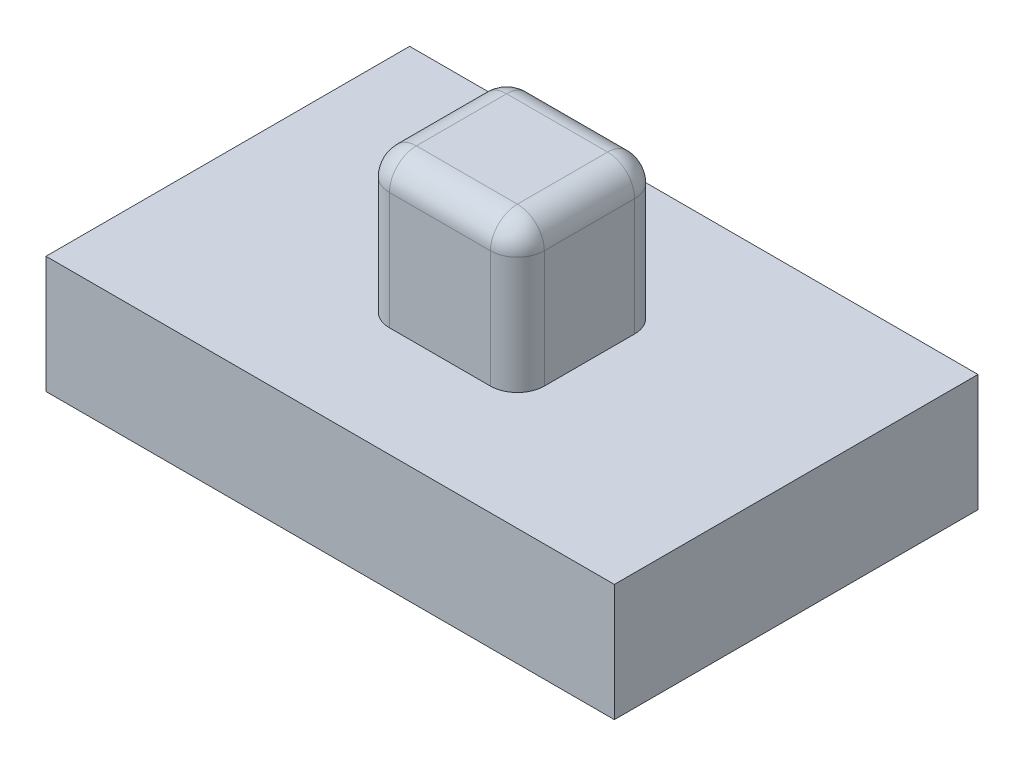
ISO-10303-21;
HEADER;
FILE_DESCRIPTION(('STEP AP214'),'2;1');
FILE_NAME('part.step','',(''),(''),'','','');
FILE_SCHEMA(('AUTOMOTIVE_DESIGN { 1 0 10303 214 1 1 1 1 }'));
ENDSEC;
DATA;
#1=APPLICATION_CONTEXT('core data for automotive mechanical design processes');
#2=APPLICATION_PROTOCOL_DEFINITION('international standard','automotive_design',2000,#1);
#3=PRODUCT_CONTEXT('',#1,'mechanical');
#4=PRODUCT('Part','Part','',(#3));
#5=PRODUCT_RELATED_PRODUCT_CATEGORY('part','',(#4));
#6=PRODUCT_DEFINITION_FORMATION('','',#4);
#7=PRODUCT_DEFINITION_CONTEXT('part definition',#1,'design');
#8=PRODUCT_DEFINITION('design','',#6,#7);
#9=PRODUCT_DEFINITION_SHAPE('','',#8);
#10=(LENGTH_UNIT() NAMED_UNIT(*) SI_UNIT(.MILLI.,.METRE.));
#11=(NAMED_UNIT(*) PLANE_ANGLE_UNIT() SI_UNIT($,.RADIAN.));
#12=(NAMED_UNIT(*) SI_UNIT($,.STERADIAN.) SOLID_ANGLE_UNIT());
#13=UNCERTAINTY_MEASURE_WITH_UNIT(LENGTH_MEASURE(1.E-05),#10,'distance_accuracy_value','');
#14=(GEOMETRIC_REPRESENTATION_CONTEXT(3) GLOBAL_UNCERTAINTY_ASSIGNED_CONTEXT((#13)) GLOBAL_UNIT_ASSIGNED_CONTEXT((#10,
#11,#12)) REPRESENTATION_CONTEXT('',''));
#15=CARTESIAN_POINT('',(0.,0.,0.));
#16=DIRECTION('',(0.,0.,1.));
#17=DIRECTION('',(1.,0.,0.));
#18=AXIS2_PLACEMENT_3D('',#15,#16,#17);
#19=CARTESIAN_POINT('',(0.,0.87,0.));
#20=DIRECTION('',(0.,-1.,0.));
#21=DIRECTION('',(0.,0.,-1.));
#22=AXIS2_PLACEMENT_3D('',#19,#20,#21);
#23=PLANE('',#22);
#24=DIRECTION('',(0.,0.,-1.));
#25=VECTOR('',#24,1.);
#26=CARTESIAN_POINT('',(2.11,0.87,1.35));
#27=LINE('',#26,#25);
#28=CARTESIAN_POINT('',(2.11,0.87,1.35));
#29=VERTEX_POINT('',#28);
#30=CARTESIAN_POINT('',(2.11,0.87,-1.35));
#31=VERTEX_POINT('',#30);
#32=EDGE_CURVE('E144',#29,#31,#27,.T.);
#33=ORIENTED_EDGE('',*,*,#32,.T.);
#34=DIRECTION('',(-1.,0.,0.));
#35=VECTOR('',#34,1.);
#36=CARTESIAN_POINT('',(-2.11,0.87,-1.35));
#37=LINE('',#36,#35);
#38=CARTESIAN_POINT('',(-2.11,0.87,-1.35));
#39=VERTEX_POINT('',#38);
#40=EDGE_CURVE('E133',#31,#39,#37,.T.);
#41=ORIENTED_EDGE('',*,*,#40,.T.);
#42=DIRECTION('',(0.,0.,1.));
#43=VECTOR('',#42,1.);
#44=CARTESIAN_POINT('',(-2.11,0.87,1.35));
#45=LINE('',#44,#43);
#46=CARTESIAN_POINT('',(-2.11,0.87,1.35));
#47=VERTEX_POINT('',#46);
#48=EDGE_CURVE('E143',#39,#47,#45,.T.);
#49=ORIENTED_EDGE('',*,*,#48,.T.);
#50=DIRECTION('',(1.,0.,0.));
#51=VECTOR('',#50,1.);
#52=CARTESIAN_POINT('',(-2.11,0.87,1.35));
#53=LINE('',#52,#51);
#54=EDGE_CURVE('E149',#47,#29,#53,.T.);
#55=ORIENTED_EDGE('',*,*,#54,.T.);
#56=EDGE_LOOP('',(#33,#41,#49,#55));
#57=FACE_BOUND('',#56,.T.);
#58=DIRECTION('',(0.,0.,-1.));
#59=VECTOR('',#58,1.);
#60=CARTESIAN_POINT('',(0.575,0.87,0.535));
#61=LINE('',#60,#59);
#62=CARTESIAN_POINT('',(0.575,0.87,0.335));
#63=VERTEX_POINT('',#62);
#64=CARTESIAN_POINT('',(0.575,0.87,-0.335));
#65=VERTEX_POINT('',#64);
#66=EDGE_CURVE('E234',#63,#65,#61,.T.);
#67=ORIENTED_EDGE('',*,*,#66,.F.);
#68=CARTESIAN_POINT('',(0.375,0.87,0.335));
#69=DIRECTION('',(0.,-1.,0.));
#70=DIRECTION('',(0.,0.,-1.));
#71=AXIS2_PLACEMENT_3D('',#68,#69,#70);
#72=CIRCLE('',#71,0.2);
#73=CARTESIAN_POINT('',(0.375,0.87,0.535));
#74=VERTEX_POINT('',#73);
#75=EDGE_CURVE('E11',#63,#74,#72,.T.);
#76=ORIENTED_EDGE('',*,*,#75,.T.);
#77=DIRECTION('',(1.,0.,0.));
#78=VECTOR('',#77,1.);
#79=CARTESIAN_POINT('',(-0.575,0.87,0.535));
#80=LINE('',#79,#78);
#81=CARTESIAN_POINT('',(-0.375,0.87,0.535));
#82=VERTEX_POINT('',#81);
#83=EDGE_CURVE('E250',#82,#74,#80,.T.);
#84=ORIENTED_EDGE('',*,*,#83,.F.);
#85=CARTESIAN_POINT('',(-0.375,0.87,0.335));
#86=DIRECTION('',(0.,-1.,0.));
#87=DIRECTION('',(0.,0.,-1.));
#88=AXIS2_PLACEMENT_3D('',#85,#86,#87);
#89=CIRCLE('',#88,0.2);
#90=CARTESIAN_POINT('',(-0.575,0.87,0.335));
#91=VERTEX_POINT('',#90);
#92=EDGE_CURVE('E41',#82,#91,#89,.T.);
#93=ORIENTED_EDGE('',*,*,#92,.T.);
#94=DIRECTION('',(0.,0.,1.));
#95=VECTOR('',#94,1.);
#96=CARTESIAN_POINT('',(-0.575,0.87,0.535));
#97=LINE('',#96,#95);
#98=CARTESIAN_POINT('',(-0.575,0.87,-0.335));
#99=VERTEX_POINT('',#98);
#100=EDGE_CURVE('E245',#99,#91,#97,.T.);
#101=ORIENTED_EDGE('',*,*,#100,.F.);
#102=CARTESIAN_POINT('',(-0.375,0.87,-0.335));
#103=DIRECTION('',(0.,-1.,0.));
#104=DIRECTION('',(0.,0.,-1.));
#105=AXIS2_PLACEMENT_3D('',#102,#103,#104);
#106=CIRCLE('',#105,0.2);
#107=CARTESIAN_POINT('',(-0.375,0.87,-0.535));
#108=VERTEX_POINT('',#107);
#109=EDGE_CURVE('E196',#99,#108,#106,.T.);
#110=ORIENTED_EDGE('',*,*,#109,.T.);
#111=DIRECTION('',(-1.,0.,0.));
#112=VECTOR('',#111,1.);
#113=CARTESIAN_POINT('',(-0.575,0.87,-0.535));
#114=LINE('',#113,#112);
#115=CARTESIAN_POINT('',(0.375,0.87,-0.535));
#116=VERTEX_POINT('',#115);
#117=EDGE_CURVE('E239',#116,#108,#114,.T.);
#118=ORIENTED_EDGE('',*,*,#117,.F.);
#119=CARTESIAN_POINT('',(0.375,0.87,-0.335));
#120=DIRECTION('',(0.,-1.,0.));
#121=DIRECTION('',(0.,0.,-1.));
#122=AXIS2_PLACEMENT_3D('',#119,#120,#121);
#123=CIRCLE('',#122,0.2);
#124=EDGE_CURVE('E194',#116,#65,#123,.T.);
#125=ORIENTED_EDGE('',*,*,#124,.T.);
#126=EDGE_LOOP('',(#67,#76,#84,#93,#101,#110,#118,#125));
#127=FACE_BOUND('',#126,.T.);
#128=ADVANCED_FACE('F32',(#57,#127),#23,.F.);
#129=CARTESIAN_POINT('',(2.11,0.87,1.35));
#130=DIRECTION('',(-1.,0.,0.));
#131=DIRECTION('',(0.,0.,1.));
#132=AXIS2_PLACEMENT_3D('',#129,#130,#131);
#133=PLANE('',#132);
#134=DIRECTION('',(0.,0.,-1.));
#135=VECTOR('',#134,1.);
#136=CARTESIAN_POINT('',(2.11,0.,1.35));
#137=LINE('',#136,#135);
#138=CARTESIAN_POINT('',(2.11,0.,1.35));
#139=VERTEX_POINT('',#138);
#140=CARTESIAN_POINT('',(2.11,0.,-1.35));
#141=VERTEX_POINT('',#140);
#142=EDGE_CURVE('E157',#139,#141,#137,.T.);
#143=ORIENTED_EDGE('',*,*,#142,.T.);
#144=DIRECTION('',(0.,-1.,0.));
#145=VECTOR('',#144,1.);
#146=CARTESIAN_POINT('',(2.11,0.87,-1.35));
#147=LINE('',#146,#145);
#148=EDGE_CURVE('E137',#31,#141,#147,.T.);
#149=ORIENTED_EDGE('',*,*,#148,.F.);
#150=ORIENTED_EDGE('',*,*,#32,.F.);
#151=DIRECTION('',(0.,-1.,0.));
#152=VECTOR('',#151,1.);
#153=CARTESIAN_POINT('',(2.11,0.87,1.35));
#154=LINE('',#153,#152);
#155=EDGE_CURVE('E255',#29,#139,#154,.T.);
#156=ORIENTED_EDGE('',*,*,#155,.T.);
#157=EDGE_LOOP('',(#143,#149,#150,#156));
#158=FACE_BOUND('',#157,.T.);
#159=ADVANCED_FACE('F155',(#158),#133,.F.);
#160=CARTESIAN_POINT('',(-2.11,0.87,-1.35));
#161=DIRECTION('',(0.,0.,1.));
#162=DIRECTION('',(1.,0.,0.));
#163=AXIS2_PLACEMENT_3D('',#160,#161,#162);
#164=PLANE('',#163);
#165=DIRECTION('',(-1.,0.,0.));
#166=VECTOR('',#165,1.);
#167=CARTESIAN_POINT('',(-2.11,0.,-1.35));
#168=LINE('',#167,#166);
#169=CARTESIAN_POINT('',(-2.11,0.,-1.35));
#170=VERTEX_POINT('',#169);
#171=EDGE_CURVE('E257',#141,#170,#168,.T.);
#172=ORIENTED_EDGE('',*,*,#171,.T.);
#173=DIRECTION('',(0.,-1.,0.));
#174=VECTOR('',#173,1.);
#175=CARTESIAN_POINT('',(-2.11,0.87,-1.35));
#176=LINE('',#175,#174);
#177=EDGE_CURVE('E140',#39,#170,#176,.T.);
#178=ORIENTED_EDGE('',*,*,#177,.F.);
#179=ORIENTED_EDGE('',*,*,#40,.F.);
#180=ORIENTED_EDGE('',*,*,#148,.T.);
#181=EDGE_LOOP('',(#172,#178,#179,#180));
#182=FACE_BOUND('',#181,.T.);
#183=ADVANCED_FACE('F135',(#182),#164,.F.);
#184=CARTESIAN_POINT('',(-2.11,0.87,1.35));
#185=DIRECTION('',(1.,0.,0.));
#186=DIRECTION('',(0.,0.,-1.));
#187=AXIS2_PLACEMENT_3D('',#184,#185,#186);
#188=PLANE('',#187);
#189=DIRECTION('',(0.,0.,1.));
#190=VECTOR('',#189,1.);
#191=CARTESIAN_POINT('',(-2.11,0.,1.35));
#192=LINE('',#191,#190);
#193=CARTESIAN_POINT('',(-2.11,0.,1.35));
#194=VERTEX_POINT('',#193);
#195=EDGE_CURVE('E259',#170,#194,#192,.T.);
#196=ORIENTED_EDGE('',*,*,#195,.T.);
#197=DIRECTION('',(0.,-1.,0.));
#198=VECTOR('',#197,1.);
#199=CARTESIAN_POINT('',(-2.11,0.87,1.35));
#200=LINE('',#199,#198);
#201=EDGE_CURVE('E162',#47,#194,#200,.T.);
#202=ORIENTED_EDGE('',*,*,#201,.F.);
#203=ORIENTED_EDGE('',*,*,#48,.F.);
#204=ORIENTED_EDGE('',*,*,#177,.T.);
#205=EDGE_LOOP('',(#196,#202,#203,#204));
#206=FACE_BOUND('',#205,.T.);
#207=ADVANCED_FACE('F271',(#206),#188,.F.);
#208=CARTESIAN_POINT('',(-2.11,0.87,1.35));
#209=DIRECTION('',(0.,0.,-1.));
#210=DIRECTION('',(-1.,0.,0.));
#211=AXIS2_PLACEMENT_3D('',#208,#209,#210);
#212=PLANE('',#211);
#213=DIRECTION('',(1.,0.,0.));
#214=VECTOR('',#213,1.);
#215=CARTESIAN_POINT('',(-2.11,0.,1.35));
#216=LINE('',#215,#214);
#217=EDGE_CURVE('E153',#194,#139,#216,.T.);
#218=ORIENTED_EDGE('',*,*,#217,.T.);
#219=ORIENTED_EDGE('',*,*,#155,.F.);
#220=ORIENTED_EDGE('',*,*,#54,.F.);
#221=ORIENTED_EDGE('',*,*,#201,.T.);
#222=EDGE_LOOP('',(#218,#219,#220,#221));
#223=FACE_BOUND('',#222,.T.);
#224=ADVANCED_FACE('F266',(#223),#212,.F.);
#225=CARTESIAN_POINT('',(0.,0.,0.));
#226=DIRECTION('',(0.,-1.,0.));
#227=DIRECTION('',(0.,0.,-1.));
#228=AXIS2_PLACEMENT_3D('',#225,#226,#227);
#229=PLANE('',#228);
#230=ORIENTED_EDGE('',*,*,#142,.F.);
#231=ORIENTED_EDGE('',*,*,#217,.F.);
#232=ORIENTED_EDGE('',*,*,#195,.F.);
#233=ORIENTED_EDGE('',*,*,#171,.F.);
#234=EDGE_LOOP('',(#230,#231,#232,#233));
#235=FACE_BOUND('',#234,.T.);
#236=ADVANCED_FACE('F270',(#235),#229,.T.);
#237=CARTESIAN_POINT('',(0.575,1.94,0.535));
#238=DIRECTION('',(-1.,0.,0.));
#239=DIRECTION('',(0.,0.,1.));
#240=AXIS2_PLACEMENT_3D('',#237,#238,#239);
#241=PLANE('',#240);
#242=ORIENTED_EDGE('',*,*,#66,.T.);
#243=DIRECTION('',(0.,-1.,0.));
#244=VECTOR('',#243,1.);
#245=CARTESIAN_POINT('',(0.575,1.94,-0.335));
#246=LINE('',#245,#244);
#247=CARTESIAN_POINT('',(0.575,1.74,-0.335));
#248=VERTEX_POINT('',#247);
#249=EDGE_CURVE('E174',#65,#248,#246,.F.);
#250=ORIENTED_EDGE('',*,*,#249,.T.);
#251=DIRECTION('',(0.,0.,-1.));
#252=VECTOR('',#251,1.);
#253=CARTESIAN_POINT('',(0.575,1.74,0.535));
#254=LINE('',#253,#252);
#255=CARTESIAN_POINT('',(0.575,1.74,0.335));
#256=VERTEX_POINT('',#255);
#257=EDGE_CURVE('E170',#248,#256,#254,.F.);
#258=ORIENTED_EDGE('',*,*,#257,.T.);
#259=DIRECTION('',(0.,-1.,0.));
#260=VECTOR('',#259,1.);
#261=CARTESIAN_POINT('',(0.575,1.94,0.335));
#262=LINE('',#261,#260);
#263=EDGE_CURVE('E172',#256,#63,#262,.T.);
#264=ORIENTED_EDGE('',*,*,#263,.T.);
#265=EDGE_LOOP('',(#242,#250,#258,#264));
#266=FACE_BOUND('',#265,.T.);
#267=ADVANCED_FACE('F288',(#266),#241,.F.);
#268=CARTESIAN_POINT('',(-0.575,1.94,-0.535));
#269=DIRECTION('',(0.,0.,1.));
#270=DIRECTION('',(1.,0.,0.));
#271=AXIS2_PLACEMENT_3D('',#268,#269,#270);
#272=PLANE('',#271);
#273=DIRECTION('',(-1.,0.,0.));
#274=VECTOR('',#273,1.);
#275=CARTESIAN_POINT('',(-0.575,1.74,-0.535));
#276=LINE('',#275,#274);
#277=CARTESIAN_POINT('',(-0.375,1.74,-0.535));
#278=VERTEX_POINT('',#277);
#279=CARTESIAN_POINT('',(0.375,1.74,-0.535));
#280=VERTEX_POINT('',#279);
#281=EDGE_CURVE('E158',#278,#280,#276,.F.);
#282=ORIENTED_EDGE('',*,*,#281,.T.);
#283=DIRECTION('',(0.,-1.,0.));
#284=VECTOR('',#283,1.);
#285=CARTESIAN_POINT('',(0.375,1.94,-0.535));
#286=LINE('',#285,#284);
#287=EDGE_CURVE('E167',#280,#116,#286,.T.);
#288=ORIENTED_EDGE('',*,*,#287,.T.);
#289=ORIENTED_EDGE('',*,*,#117,.T.);
#290=DIRECTION('',(0.,-1.,0.));
#291=VECTOR('',#290,1.);
#292=CARTESIAN_POINT('',(-0.375,1.94,-0.535));
#293=LINE('',#292,#291);
#294=EDGE_CURVE('E160',#108,#278,#293,.F.);
#295=ORIENTED_EDGE('',*,*,#294,.T.);
#296=EDGE_LOOP('',(#282,#288,#289,#295));
#297=FACE_BOUND('',#296,.T.);
#298=ADVANCED_FACE('F294',(#297),#272,.F.);
#299=CARTESIAN_POINT('',(-0.575,1.94,0.535));
#300=DIRECTION('',(1.,0.,0.));
#301=DIRECTION('',(0.,0.,-1.));
#302=AXIS2_PLACEMENT_3D('',#299,#300,#301);
#303=PLANE('',#302);
#304=DIRECTION('',(0.,0.,1.));
#305=VECTOR('',#304,1.);
#306=CARTESIAN_POINT('',(-0.575,1.74,0.535));
#307=LINE('',#306,#305);
#308=CARTESIAN_POINT('',(-0.575,1.74,0.335));
#309=VERTEX_POINT('',#308);
#310=CARTESIAN_POINT('',(-0.575,1.74,-0.335));
#311=VERTEX_POINT('',#310);
#312=EDGE_CURVE('E176',#309,#311,#307,.F.);
#313=ORIENTED_EDGE('',*,*,#312,.T.);
#314=DIRECTION('',(0.,-1.,0.));
#315=VECTOR('',#314,1.);
#316=CARTESIAN_POINT('',(-0.575,1.94,-0.335));
#317=LINE('',#316,#315);
#318=EDGE_CURVE('E180',#311,#99,#317,.T.);
#319=ORIENTED_EDGE('',*,*,#318,.T.);
#320=ORIENTED_EDGE('',*,*,#100,.T.);
#321=DIRECTION('',(0.,-1.,0.));
#322=VECTOR('',#321,1.);
#323=CARTESIAN_POINT('',(-0.575,1.94,0.335));
#324=LINE('',#323,#322);
#325=EDGE_CURVE('E178',#91,#309,#324,.F.);
#326=ORIENTED_EDGE('',*,*,#325,.T.);
#327=EDGE_LOOP('',(#313,#319,#320,#326));
#328=FACE_BOUND('',#327,.T.);
#329=ADVANCED_FACE('F298',(#328),#303,.F.);
#330=CARTESIAN_POINT('',(-0.575,1.94,0.535));
#331=DIRECTION('',(0.,0.,-1.));
#332=DIRECTION('',(-1.,0.,0.));
#333=AXIS2_PLACEMENT_3D('',#330,#331,#332);
#334=PLANE('',#333);
#335=DIRECTION('',(1.,0.,0.));
#336=VECTOR('',#335,1.);
#337=CARTESIAN_POINT('',(-0.575,1.74,0.535));
#338=LINE('',#337,#336);
#339=CARTESIAN_POINT('',(0.375,1.74,0.535));
#340=VERTEX_POINT('',#339);
#341=CARTESIAN_POINT('',(-0.375,1.74,0.535));
#342=VERTEX_POINT('',#341);
#343=EDGE_CURVE('E182',#340,#342,#338,.F.);
#344=ORIENTED_EDGE('',*,*,#343,.T.);
#345=DIRECTION('',(0.,-1.,0.));
#346=VECTOR('',#345,1.);
#347=CARTESIAN_POINT('',(-0.375,1.94,0.535));
#348=LINE('',#347,#346);
#349=EDGE_CURVE('E186',#342,#82,#348,.T.);
#350=ORIENTED_EDGE('',*,*,#349,.T.);
#351=ORIENTED_EDGE('',*,*,#83,.T.);
#352=DIRECTION('',(0.,-1.,0.));
#353=VECTOR('',#352,1.);
#354=CARTESIAN_POINT('',(0.375,1.94,0.535));
#355=LINE('',#354,#353);
#356=EDGE_CURVE('E184',#74,#340,#355,.F.);
#357=ORIENTED_EDGE('',*,*,#356,.T.);
#358=EDGE_LOOP('',(#344,#350,#351,#357));
#359=FACE_BOUND('',#358,.T.);
#360=ADVANCED_FACE('F303',(#359),#334,.F.);
#361=CARTESIAN_POINT('',(0.,1.94,0.));
#362=DIRECTION('',(0.,-1.,0.));
#363=DIRECTION('',(0.,0.,-1.));
#364=AXIS2_PLACEMENT_3D('',#361,#362,#363);
#365=PLANE('',#364);
#366=DIRECTION('',(0.,0.,1.));
#367=VECTOR('',#366,1.);
#368=CARTESIAN_POINT('',(-0.375,1.94,0.));
#369=LINE('',#368,#367);
#370=CARTESIAN_POINT('',(-0.375,1.94,-0.335));
#371=VERTEX_POINT('',#370);
#372=CARTESIAN_POINT('',(-0.375,1.94,0.335));
#373=VERTEX_POINT('',#372);
#374=EDGE_CURVE('E49',#371,#373,#369,.T.);
#375=ORIENTED_EDGE('',*,*,#374,.T.);
#376=DIRECTION('',(1.,0.,0.));
#377=VECTOR('',#376,1.);
#378=CARTESIAN_POINT('',(0.,1.94,0.335));
#379=LINE('',#378,#377);
#380=CARTESIAN_POINT('',(0.375,1.94,0.335));
#381=VERTEX_POINT('',#380);
#382=EDGE_CURVE('E192',#373,#381,#379,.T.);
#383=ORIENTED_EDGE('',*,*,#382,.T.);
#384=DIRECTION('',(0.,0.,-1.));
#385=VECTOR('',#384,1.);
#386=CARTESIAN_POINT('',(0.375,1.94,0.));
#387=LINE('',#386,#385);
#388=CARTESIAN_POINT('',(0.375,1.94,-0.335));
#389=VERTEX_POINT('',#388);
#390=EDGE_CURVE('E188',#381,#389,#387,.T.);
#391=ORIENTED_EDGE('',*,*,#390,.T.);
#392=DIRECTION('',(-1.,0.,0.));
#393=VECTOR('',#392,1.);
#394=CARTESIAN_POINT('',(0.,1.94,-0.335));
#395=LINE('',#394,#393);
#396=EDGE_CURVE('E54',#389,#371,#395,.T.);
#397=ORIENTED_EDGE('',*,*,#396,.T.);
#398=EDGE_LOOP('',(#375,#383,#391,#397));
#399=FACE_BOUND('',#398,.T.);
#400=ADVANCED_FACE('F309',(#399),#365,.F.);
#401=CARTESIAN_POINT('',(-0.375,1.94,0.335));
#402=DIRECTION('',(0.,-1.,0.));
#403=DIRECTION('',(0.,0.,-1.));
#404=AXIS2_PLACEMENT_3D('',#401,#402,#403);
#405=CYLINDRICAL_SURFACE('',#404,0.2);
#406=CARTESIAN_POINT('',(-0.375,1.74,0.335));
#407=DIRECTION('',(0.,1.,0.));
#408=DIRECTION('',(0.,0.,1.));
#409=AXIS2_PLACEMENT_3D('',#406,#407,#408);
#410=CIRCLE('',#409,0.2);
#411=EDGE_CURVE('E36',#309,#342,#410,.T.);
#412=ORIENTED_EDGE('',*,*,#411,.F.);
#413=ORIENTED_EDGE('',*,*,#325,.F.);
#414=ORIENTED_EDGE('',*,*,#92,.F.);
#415=ORIENTED_EDGE('',*,*,#349,.F.);
#416=EDGE_LOOP('',(#412,#413,#414,#415));
#417=FACE_BOUND('',#416,.T.);
#418=ADVANCED_FACE('F34',(#417),#405,.T.);
#419=CARTESIAN_POINT('',(-0.375,1.74,0.335));
#420=DIRECTION('',(0.,0.,1.));
#421=DIRECTION('',(1.,0.,0.));
#422=AXIS2_PLACEMENT_3D('',#419,#420,#421);
#423=SPHERICAL_SURFACE('',#422,0.2);
#424=CARTESIAN_POINT('',(-0.375,1.74,0.335));
#425=DIRECTION('',(0.,0.,1.));
#426=DIRECTION('',(1.,0.,0.));
#427=AXIS2_PLACEMENT_3D('',#424,#425,#426);
#428=CIRCLE('',#427,0.2);
#429=EDGE_CURVE('E226',#309,#373,#428,.F.);
#430=ORIENTED_EDGE('',*,*,#429,.F.);
#431=ORIENTED_EDGE('',*,*,#411,.T.);
#432=CARTESIAN_POINT('',(-0.375,1.74,0.335));
#433=DIRECTION('',(-1.,0.,0.));
#434=DIRECTION('',(0.,0.,1.));
#435=AXIS2_PLACEMENT_3D('',#432,#433,#434);
#436=CIRCLE('',#435,0.2);
#437=EDGE_CURVE('E227',#373,#342,#436,.F.);
#438=ORIENTED_EDGE('',*,*,#437,.F.);
#439=EDGE_LOOP('',(#430,#431,#438));
#440=FACE_BOUND('',#439,.T.);
#441=ADVANCED_FACE('F315',(#440),#423,.T.);
#442=CARTESIAN_POINT('',(0.375,1.94,0.335));
#443=DIRECTION('',(0.,-1.,0.));
#444=DIRECTION('',(0.,0.,-1.));
#445=AXIS2_PLACEMENT_3D('',#442,#443,#444);
#446=CYLINDRICAL_SURFACE('',#445,0.2);
#447=ORIENTED_EDGE('',*,*,#75,.F.);
#448=ORIENTED_EDGE('',*,*,#263,.F.);
#449=CARTESIAN_POINT('',(0.375,1.74,0.335));
#450=DIRECTION('',(0.,1.,0.));
#451=DIRECTION('',(0.,0.,1.));
#452=AXIS2_PLACEMENT_3D('',#449,#450,#451);
#453=CIRCLE('',#452,0.2);
#454=EDGE_CURVE('E223',#340,#256,#453,.T.);
#455=ORIENTED_EDGE('',*,*,#454,.F.);
#456=ORIENTED_EDGE('',*,*,#356,.F.);
#457=EDGE_LOOP('',(#447,#448,#455,#456));
#458=FACE_BOUND('',#457,.T.);
#459=ADVANCED_FACE('F320',(#458),#446,.T.);
#460=CARTESIAN_POINT('',(0.,1.74,0.335));
#461=DIRECTION('',(1.,0.,0.));
#462=DIRECTION('',(0.,0.,-1.));
#463=AXIS2_PLACEMENT_3D('',#460,#461,#462);
#464=CYLINDRICAL_SURFACE('',#463,0.2);
#465=ORIENTED_EDGE('',*,*,#437,.T.);
#466=ORIENTED_EDGE('',*,*,#343,.F.);
#467=CARTESIAN_POINT('',(0.375,1.74,0.335));
#468=DIRECTION('',(1.,0.,0.));
#469=DIRECTION('',(0.,0.,-1.));
#470=AXIS2_PLACEMENT_3D('',#467,#468,#469);
#471=CIRCLE('',#470,0.2);
#472=EDGE_CURVE('E220',#381,#340,#471,.T.);
#473=ORIENTED_EDGE('',*,*,#472,.F.);
#474=ORIENTED_EDGE('',*,*,#382,.F.);
#475=EDGE_LOOP('',(#465,#466,#473,#474));
#476=FACE_BOUND('',#475,.T.);
#477=ADVANCED_FACE('F350',(#476),#464,.T.);
#478=CARTESIAN_POINT('',(-0.375,1.74,0.));
#479=DIRECTION('',(0.,0.,1.));
#480=DIRECTION('',(1.,0.,0.));
#481=AXIS2_PLACEMENT_3D('',#478,#479,#480);
#482=CYLINDRICAL_SURFACE('',#481,0.2);
#483=ORIENTED_EDGE('',*,*,#429,.T.);
#484=ORIENTED_EDGE('',*,*,#374,.F.);
#485=CARTESIAN_POINT('',(-0.375,1.74,-0.335));
#486=DIRECTION('',(0.,0.,-1.));
#487=DIRECTION('',(-1.,0.,0.));
#488=AXIS2_PLACEMENT_3D('',#485,#486,#487);
#489=CIRCLE('',#488,0.2);
#490=EDGE_CURVE('E217',#311,#371,#489,.T.);
#491=ORIENTED_EDGE('',*,*,#490,.F.);
#492=ORIENTED_EDGE('',*,*,#312,.F.);
#493=EDGE_LOOP('',(#483,#484,#491,#492));
#494=FACE_BOUND('',#493,.T.);
#495=ADVANCED_FACE('F327',(#494),#482,.T.);
#496=CARTESIAN_POINT('',(-0.375,1.94,-0.335));
#497=DIRECTION('',(0.,-1.,0.));
#498=DIRECTION('',(0.,0.,-1.));
#499=AXIS2_PLACEMENT_3D('',#496,#497,#498);
#500=CYLINDRICAL_SURFACE('',#499,0.2);
#501=ORIENTED_EDGE('',*,*,#109,.F.);
#502=ORIENTED_EDGE('',*,*,#318,.F.);
#503=CARTESIAN_POINT('',(-0.375,1.74,-0.335));
#504=DIRECTION('',(0.,1.,0.));
#505=DIRECTION('',(0.,0.,1.));
#506=AXIS2_PLACEMENT_3D('',#503,#504,#505);
#507=CIRCLE('',#506,0.2);
#508=EDGE_CURVE('E214',#278,#311,#507,.T.);
#509=ORIENTED_EDGE('',*,*,#508,.F.);
#510=ORIENTED_EDGE('',*,*,#294,.F.);
#511=EDGE_LOOP('',(#501,#502,#509,#510));
#512=FACE_BOUND('',#511,.T.);
#513=ADVANCED_FACE('F333',(#512),#500,.T.);
#514=CARTESIAN_POINT('',(0.375,1.74,0.335));
#515=DIRECTION('',(0.,0.,1.));
#516=DIRECTION('',(1.,0.,0.));
#517=AXIS2_PLACEMENT_3D('',#514,#515,#516);
#518=SPHERICAL_SURFACE('',#517,0.2);
#519=ORIENTED_EDGE('',*,*,#472,.T.);
#520=ORIENTED_EDGE('',*,*,#454,.T.);
#521=CARTESIAN_POINT('',(0.375,1.74,0.335));
#522=DIRECTION('',(0.,0.,1.));
#523=DIRECTION('',(1.,0.,0.));
#524=AXIS2_PLACEMENT_3D('',#521,#522,#523);
#525=CIRCLE('',#524,0.2);
#526=EDGE_CURVE('E211',#381,#256,#525,.F.);
#527=ORIENTED_EDGE('',*,*,#526,.F.);
#528=EDGE_LOOP('',(#519,#520,#527));
#529=FACE_BOUND('',#528,.T.);
#530=ADVANCED_FACE('F375',(#529),#518,.T.);
#531=CARTESIAN_POINT('',(-0.375,1.74,-0.335));
#532=DIRECTION('',(0.,0.,1.));
#533=DIRECTION('',(1.,0.,0.));
#534=AXIS2_PLACEMENT_3D('',#531,#532,#533);
#535=SPHERICAL_SURFACE('',#534,0.2);
#536=ORIENTED_EDGE('',*,*,#508,.T.);
#537=ORIENTED_EDGE('',*,*,#490,.T.);
#538=CARTESIAN_POINT('',(-0.375,1.74,-0.335));
#539=DIRECTION('',(-1.,0.,0.));
#540=DIRECTION('',(0.,0.,1.));
#541=AXIS2_PLACEMENT_3D('',#538,#539,#540);
#542=CIRCLE('',#541,0.2);
#543=EDGE_CURVE('E208',#278,#371,#542,.F.);
#544=ORIENTED_EDGE('',*,*,#543,.F.);
#545=EDGE_LOOP('',(#536,#537,#544));
#546=FACE_BOUND('',#545,.T.);
#547=ADVANCED_FACE('F372',(#546),#535,.T.);
#548=CARTESIAN_POINT('',(0.375,1.74,0.));
#549=DIRECTION('',(0.,0.,-1.));
#550=DIRECTION('',(-1.,0.,0.));
#551=AXIS2_PLACEMENT_3D('',#548,#549,#550);
#552=CYLINDRICAL_SURFACE('',#551,0.2);
#553=ORIENTED_EDGE('',*,*,#526,.T.);
#554=ORIENTED_EDGE('',*,*,#257,.F.);
#555=CARTESIAN_POINT('',(0.375,1.74,-0.335));
#556=DIRECTION('',(0.,0.,-1.));
#557=DIRECTION('',(-1.,0.,0.));
#558=AXIS2_PLACEMENT_3D('',#555,#556,#557);
#559=CIRCLE('',#558,0.2);
#560=EDGE_CURVE('E205',#389,#248,#559,.T.);
#561=ORIENTED_EDGE('',*,*,#560,.F.);
#562=ORIENTED_EDGE('',*,*,#390,.F.);
#563=EDGE_LOOP('',(#553,#554,#561,#562));
#564=FACE_BOUND('',#563,.T.);
#565=ADVANCED_FACE('F358',(#564),#552,.T.);
#566=CARTESIAN_POINT('',(0.,1.74,-0.335));
#567=DIRECTION('',(-1.,0.,0.));
#568=DIRECTION('',(0.,0.,1.));
#569=AXIS2_PLACEMENT_3D('',#566,#567,#568);
#570=CYLINDRICAL_SURFACE('',#569,0.2);
#571=ORIENTED_EDGE('',*,*,#543,.T.);
#572=ORIENTED_EDGE('',*,*,#396,.F.);
#573=CARTESIAN_POINT('',(0.375,1.74,-0.335));
#574=DIRECTION('',(1.,0.,0.));
#575=DIRECTION('',(0.,0.,-1.));
#576=AXIS2_PLACEMENT_3D('',#573,#574,#575);
#577=CIRCLE('',#576,0.2);
#578=EDGE_CURVE('E202',#280,#389,#577,.T.);
#579=ORIENTED_EDGE('',*,*,#578,.F.);
#580=ORIENTED_EDGE('',*,*,#281,.F.);
#581=EDGE_LOOP('',(#571,#572,#579,#580));
#582=FACE_BOUND('',#581,.T.);
#583=ADVANCED_FACE('F356',(#582),#570,.T.);
#584=CARTESIAN_POINT('',(0.375,1.74,-0.335));
#585=DIRECTION('',(0.,0.,1.));
#586=DIRECTION('',(1.,0.,0.));
#587=AXIS2_PLACEMENT_3D('',#584,#585,#586);
#588=SPHERICAL_SURFACE('',#587,0.2);
#589=ORIENTED_EDGE('',*,*,#578,.T.);
#590=ORIENTED_EDGE('',*,*,#560,.T.);
#591=CARTESIAN_POINT('',(0.375,1.74,-0.335));
#592=DIRECTION('',(0.,1.,0.));
#593=DIRECTION('',(0.,0.,1.));
#594=AXIS2_PLACEMENT_3D('',#591,#592,#593);
#595=CIRCLE('',#594,0.2);
#596=EDGE_CURVE('E199',#280,#248,#595,.F.);
#597=ORIENTED_EDGE('',*,*,#596,.F.);
#598=EDGE_LOOP('',(#589,#590,#597));
#599=FACE_BOUND('',#598,.T.);
#600=ADVANCED_FACE('F360',(#599),#588,.T.);
#601=CARTESIAN_POINT('',(0.375,1.94,-0.335));
#602=DIRECTION('',(0.,-1.,0.));
#603=DIRECTION('',(0.,0.,-1.));
#604=AXIS2_PLACEMENT_3D('',#601,#602,#603);
#605=CYLINDRICAL_SURFACE('',#604,0.2);
#606=ORIENTED_EDGE('',*,*,#596,.T.);
#607=ORIENTED_EDGE('',*,*,#249,.F.);
#608=ORIENTED_EDGE('',*,*,#124,.F.);
#609=ORIENTED_EDGE('',*,*,#287,.F.);
#610=EDGE_LOOP('',(#606,#607,#608,#609));
#611=FACE_BOUND('',#610,.T.);
#612=ADVANCED_FACE('F341',(#611),#605,.T.);
#613=CLOSED_SHELL('',(#128,#159,#183,#207,#224,#236,#267,#298,#329,#360,#400,#418,#441,#459,
#477,#495,#513,#530,#547,#565,#583,#600,#612));
#614=MANIFOLD_SOLID_BREP('B2',#613);
#615=ADVANCED_BREP_SHAPE_REPRESENTATION('',(#18,#614),#14);
#616=SHAPE_DEFINITION_REPRESENTATION(#9,#615);
ENDSEC;
END-ISO-10303-21;
